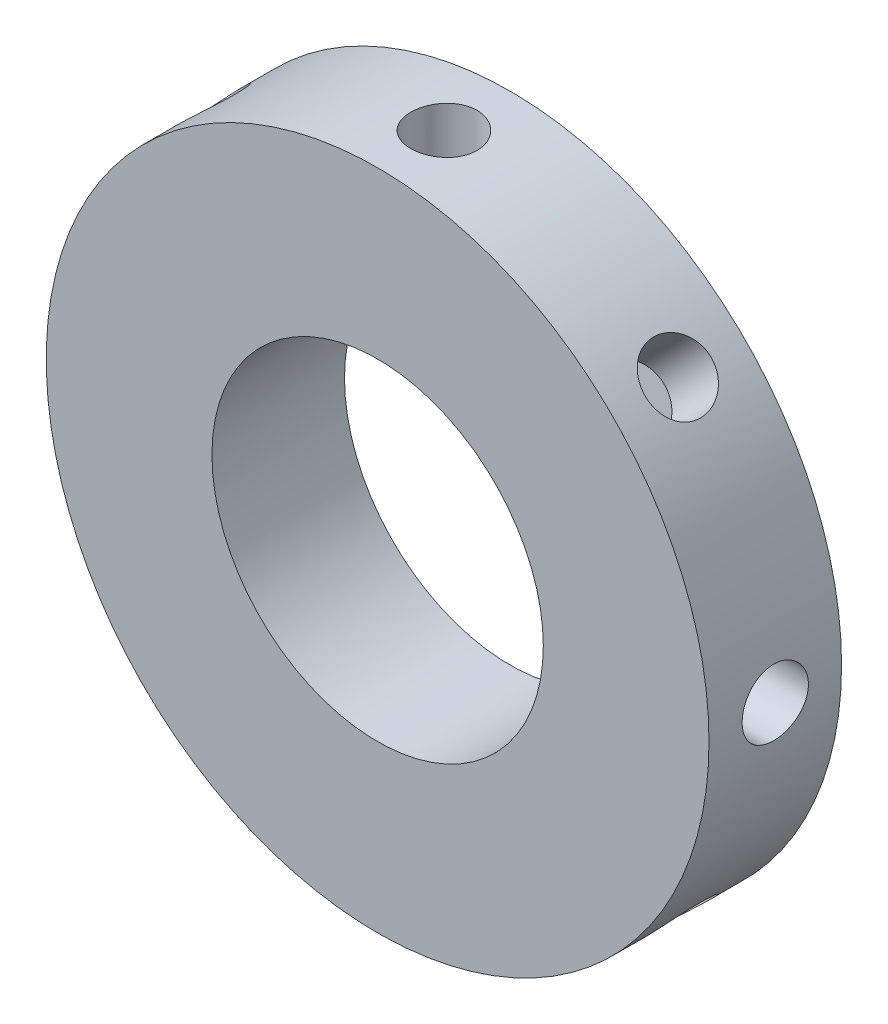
from build123d import *

# Parameters (mm, degrees)
CROQUIS1_R              = 100
CROQUIS1_R_2            = 50
SALIENTE_EXTRUIR1_DEPTH = 40
CROQUIS2_R              = 10
CORTAR_EXTRUIR1_DEPTH   = 20
MATRIZC1_COUNT          = 8


with BuildPart() as part:
    # Croquis1 → Saliente-Extruir1 (new body)
    with BuildSketch(Plane.XY):
        Circle(CROQUIS1_R)
        Circle(CROQUIS1_R_2, mode=Mode.SUBTRACT)
    extrude(amount=SALIENTE_EXTRUIR1_DEPTH)

    # Croquis2 → Cortar-Extruir1 (cut)
    with BuildSketch(Plane(origin=(100, 0, 0), x_dir=(0, 0, -1), z_dir=(1, 0, 0))):
        with Locations((-20, 0)):
            Circle(CROQUIS2_R)
    cortar_extruir1 = extrude(amount=-CORTAR_EXTRUIR1_DEPTH, mode=Mode.SUBTRACT)

    # MatrizC1: Cortar-Extruir1 ×8 about axis
    matrizc1_axis = Axis((0, 0, 0), (0, 0, 1))
    for i in range(1, MATRIZC1_COUNT):
        add(cortar_extruir1.rotate(matrizc1_axis, i * 360 / MATRIZC1_COUNT), mode=Mode.SUBTRACT)


solid = part.part
